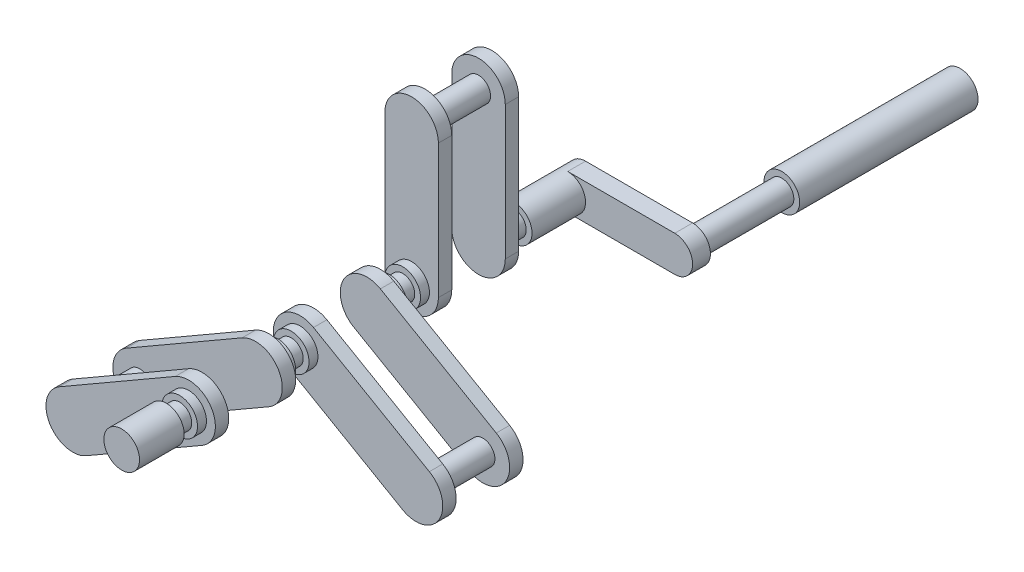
from build123d import *

# Parameters (mm, degrees)
SKETCH_1_R       = 1.35
EXTRUDE_1_DEPTH  = 2.5
EXTRUDE_2_DEPTH  = 1.5
SKETCH_3_R       = 1.35
EXTRUDE_3_DEPTH  = 6
EXTRUDE_4_DEPTH  = 1.5
SKETCH_5_R       = 1.35
EXTRUDE_5_DEPTH  = 3.5
EXTRUDE_6_DEPTH  = 1.5
SKETCH_7_R       = 1.35
EXTRUDE_7_DEPTH  = 6
EXTRUDE_8_DEPTH  = 1.5
SKETCH_9_R       = 2
EXTRUDE_9_DEPTH  = 1
EXTRUDE_START    = 1
SKETCH_10_R      = 2
EXTRUDE_10_DEPTH = 1
SKETCH_11_R      = 1.35
EXTRUDE_11_DEPTH = 3.5
EXTRUDE_12_DEPTH = 1.5
SKETCH_15_R      = 1.35
EXTRUDE_15_DEPTH = 6
EXTRUDE_16_DEPTH = 1.5
SKETCH_17_R      = 2
EXTRUDE_17_DEPTH = 1
SKETCH_18_R      = 2
EXTRUDE_18_DEPTH = 1
SKETCH_19_R      = 1.35
EXTRUDE_19_DEPTH = 2.5
SKETCH_20_R      = 2
EXTRUDE_20_DEPTH = 1
EXTRUDE_START_2  = 8
SKETCH_21_R      = 2
EXTRUDE_21_DEPTH = 8
EXTRUDE_22_DEPTH = 2
SKETCH_23_R      = 1.35
EXTRUDE_23_DEPTH = 10
EXTRUDE_START_3  = 20
SKETCH_24_R      = 2
EXTRUDE_24_DEPTH = 20
SKETCH_25_R      = 2
EXTRUDE_25_DEPTH = 1
SKETCH_26_R      = 2
EXTRUDE_26_DEPTH = 5


with BuildPart() as part:
    # Sketch 1 → Extrude 1 (new body)
    with BuildSketch(Plane.XY):
        Circle(SKETCH_1_R)
    extrude(amount=EXTRUDE_1_DEPTH)

    # Sketch 2 → Extrude 2 (add)
    with BuildSketch(Plane.XY.offset(2.5)):
        with BuildLine():
            Line((3, 15), (3, 0))
            ThreePointArc((3, 0), (0, -3), (-3, 0))
            Line((-3, 0), (-3, 15))
            ThreePointArc((-3, 15), (0, 18), (3, 15))
        make_face()
    extrude(amount=EXTRUDE_2_DEPTH)

    # Sketch 3 → Extrude 3 (add)
    with BuildSketch(Plane.XY.offset(4)):
        with Locations((0, 15)):
            Circle(SKETCH_3_R)
    extrude(amount=EXTRUDE_3_DEPTH)

    # Sketch 4 → Extrude 4 (add)
    with BuildSketch(Plane.XY.offset(10)):
        with BuildLine():
            Line((3, 15), (3, 0))
            ThreePointArc((3, 0), (0, -3), (-3, 0))
            Line((-3, 0), (-3, 15))
            ThreePointArc((-3, 15), (0, 18), (3, 15))
        make_face()
    extrude(amount=EXTRUDE_4_DEPTH)

    # Sketch 5 → Extrude 5 (add)
    with BuildSketch(Plane.XY.offset(11.5)):
        Circle(SKETCH_5_R)
    extrude(amount=EXTRUDE_5_DEPTH)

    # Sketch 6 → Extrude 6 (add)
    with BuildSketch(Plane.XY.offset(15)):
        with BuildLine():
            Line((14.490381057, -4.901923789), (1.5, 2.598076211))
            ThreePointArc((1.5, 2.598076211), (-2.598076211, 1.5), (-1.5, -2.598076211))
            Line((-1.5, -2.598076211), (11.490381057, -10.098076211))
            ThreePointArc((11.490381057, -10.098076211), (15.588457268, -9), (14.490381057, -4.901923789))
        make_face()
    extrude(amount=EXTRUDE_6_DEPTH)

    # Sketch 7 → Extrude 7 (add)
    with BuildSketch(Plane.XY.offset(16.5)):
        with Locations((12.990381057, -7.5)):
            Circle(SKETCH_7_R)
    extrude(amount=EXTRUDE_7_DEPTH)

    # Sketch 8 → Extrude 8 (add)
    with BuildSketch(Plane.XY.offset(22.5)):
        with BuildLine():
            Line((1.5, 2.598076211), (14.490381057, -4.901923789))
            ThreePointArc((14.490381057, -4.901923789), (15.588457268, -9), (11.490381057, -10.098076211))
            Line((11.490381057, -10.098076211), (-1.5, -2.598076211))
            ThreePointArc((-1.5, -2.598076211), (-2.598076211, 1.5), (1.5, 2.598076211))
        make_face()
    extrude(amount=EXTRUDE_8_DEPTH)

    # Sketch 9 → Extrude 9 (add)
    with BuildSketch(Plane.XY.offset(11.5)):
        Circle(SKETCH_9_R)
    extrude(amount=EXTRUDE_9_DEPTH)

    # Sketch 10 → Extrude 10 (add)
    with BuildSketch(Plane(origin=(0, 0, 15), x_dir=(-1, 0, 0), z_dir=(0, 0, -1)).offset(EXTRUDE_START)):
        with Locations(Location((0, 0, 0), (0, 0, 180))):
            Circle(SKETCH_10_R)
    extrude(amount=-EXTRUDE_10_DEPTH)

    # Sketch 11 → Extrude 11 (add)
    with BuildSketch(Plane.XY.offset(24)):
        Circle(SKETCH_11_R)
    extrude(amount=EXTRUDE_11_DEPTH)

    # Sketch 12 → Extrude 12 (add)
    with BuildSketch(Plane.XY.offset(27.5)):
        with BuildLine():
            Line((-1.5, 2.598076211), (-14.490381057, -4.901923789))
            ThreePointArc((-14.490381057, -4.901923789), (-15.588457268, -9), (-11.490381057, -10.098076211))
            Line((-11.490381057, -10.098076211), (1.5, -2.598076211))
            ThreePointArc((1.5, -2.598076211), (2.598076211, 1.5), (-1.5, 2.598076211))
        make_face()
    extrude(amount=EXTRUDE_12_DEPTH)

    # Sketch 15 → Extrude 15 (add)
    with BuildSketch(Plane.XY.offset(29)):
        with Locations((-12.990381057, -7.5)):
            Circle(SKETCH_15_R)
    extrude(amount=EXTRUDE_15_DEPTH)

    # Sketch 16 → Extrude 16 (add)
    with BuildSketch(Plane.XY.offset(35)):
        with BuildLine():
            Line((-1.5, 2.598076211), (-14.490381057, -4.901923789))
            ThreePointArc((-14.490381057, -4.901923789), (-15.588457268, -9), (-11.490381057, -10.098076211))
            Line((-11.490381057, -10.098076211), (1.5, -2.598076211))
            ThreePointArc((1.5, -2.598076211), (2.598076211, 1.5), (-1.5, 2.598076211))
        make_face()
    extrude(amount=EXTRUDE_16_DEPTH)

    # Sketch 17 → Extrude 17 (add)
    with BuildSketch(Plane.XY.offset(24)):
        Circle(SKETCH_17_R)
    extrude(amount=EXTRUDE_17_DEPTH)

    # Sketch 18 → Extrude 18 (add)
    with BuildSketch(Plane(origin=(0, 0, 27.5), x_dir=(-1, 0, 0), z_dir=(0, 0, -1)).offset(EXTRUDE_START)):
        with Locations(Location((0, 0, 0), (0, 0, 180))):
            Circle(SKETCH_18_R)
    extrude(amount=-EXTRUDE_18_DEPTH)

    # Sketch 19 → Extrude 19 (add)
    with BuildSketch(Plane.XY.offset(36.5)):
        Circle(SKETCH_19_R)
    extrude(amount=EXTRUDE_19_DEPTH)

    # Sketch 20 → Extrude 20 (add)
    with BuildSketch(Plane(origin=(0, 0, 2.5), x_dir=(-1, 0, 0), z_dir=(0, 0, -1)).offset(EXTRUDE_START)):
        with Locations(Location((0, 0, 0), (0, 0, 180))):
            Circle(SKETCH_20_R)
    extrude(amount=-EXTRUDE_20_DEPTH)

    # Sketch 21 → Extrude 21 (add)
    with BuildSketch(Plane(origin=(0, 0, 0), x_dir=(-1, 0, 0), z_dir=(0, 0, -1)).offset(EXTRUDE_START_2)):
        with Locations(Location((0, 0, 0), (0, 0, 180))):
            Circle(SKETCH_21_R)
    extrude(amount=-EXTRUDE_21_DEPTH)

    # Sketch 22 → Extrude 22 (add)
    with BuildSketch(Plane(origin=(0, 0, -8), x_dir=(-1, 0, 0), z_dir=(0, 0, -1))):
        with BuildLine():
            ThreePointArc((0, -2), (-1.414213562, -1.414213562), (-2, 0))
            ThreePointArc((-2, 0), (-1.414213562, 1.414213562), (0, 2))
            Line((0, 2), (-12, 2))
            ThreePointArc((-12, 2), (-14, 0), (-12, -2))
            Line((-12, -2), (0, -2))
        make_face()
    extrude(amount=-EXTRUDE_22_DEPTH)

    # Sketch 23 → Extrude 23 (add)
    with BuildSketch(Plane(origin=(0, 0, -8), x_dir=(-1, 0, 0), z_dir=(0, 0, -1))):
        with Locations((-12, 0)):
            Circle(SKETCH_23_R)
    extrude(amount=EXTRUDE_23_DEPTH)

    # Sketch 24 → Extrude 24 (add)
    with BuildSketch(Plane(origin=(0, 0, -18), x_dir=(-1, 0, 0), z_dir=(0, 0, -1)).offset(EXTRUDE_START_3)):
        with Locations((-12, 0)):
            Circle(SKETCH_24_R)
    extrude(amount=-EXTRUDE_24_DEPTH)

    # Sketch 25 → Extrude 25 (add)
    with BuildSketch(Plane.XY.offset(36.5)):
        with Locations(Location((0, 0, 0), (0, 0, 90))):
            Circle(SKETCH_25_R)
    extrude(amount=EXTRUDE_25_DEPTH)

    # Sketch 26 → Extrude 26 (add)
    with BuildSketch(Plane.XY.offset(39)):
        with Locations(Location((0, 0, 0), (0, 0, 90))):
            Circle(SKETCH_26_R)
    extrude(amount=EXTRUDE_26_DEPTH)


solid = part.part
